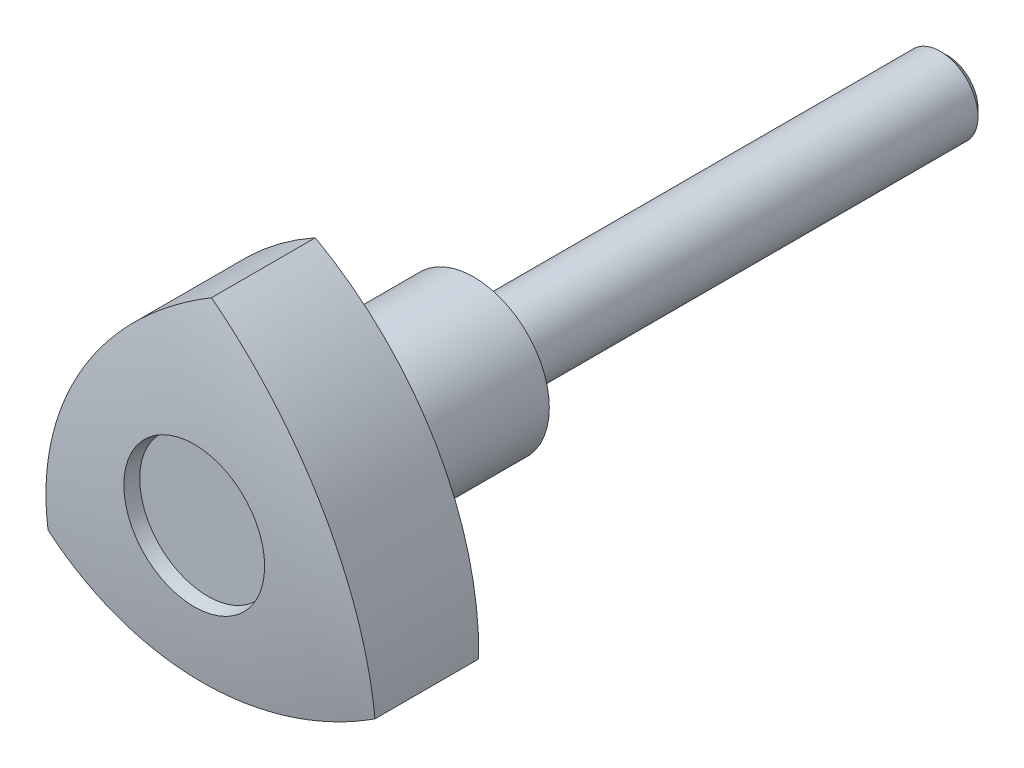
ISO-10303-21;
HEADER;
FILE_DESCRIPTION(('STEP AP214'),'2;1');
FILE_NAME('part.step','',(''),(''),'','','');
FILE_SCHEMA(('AUTOMOTIVE_DESIGN { 1 0 10303 214 1 1 1 1 }'));
ENDSEC;
DATA;
#1=APPLICATION_CONTEXT('core data for automotive mechanical design processes');
#2=APPLICATION_PROTOCOL_DEFINITION('international standard','automotive_design',2000,#1);
#3=PRODUCT_CONTEXT('',#1,'mechanical');
#4=PRODUCT('Part','Part','',(#3));
#5=PRODUCT_RELATED_PRODUCT_CATEGORY('part','',(#4));
#6=PRODUCT_DEFINITION_FORMATION('','',#4);
#7=PRODUCT_DEFINITION_CONTEXT('part definition',#1,'design');
#8=PRODUCT_DEFINITION('design','',#6,#7);
#9=PRODUCT_DEFINITION_SHAPE('','',#8);
#10=(LENGTH_UNIT() NAMED_UNIT(*) SI_UNIT(.MILLI.,.METRE.));
#11=(NAMED_UNIT(*) PLANE_ANGLE_UNIT() SI_UNIT($,.RADIAN.));
#12=(NAMED_UNIT(*) SI_UNIT($,.STERADIAN.) SOLID_ANGLE_UNIT());
#13=UNCERTAINTY_MEASURE_WITH_UNIT(LENGTH_MEASURE(1.E-05),#10,'distance_accuracy_value','');
#14=(GEOMETRIC_REPRESENTATION_CONTEXT(3) GLOBAL_UNCERTAINTY_ASSIGNED_CONTEXT((#13)) GLOBAL_UNIT_ASSIGNED_CONTEXT((#10,
#11,#12)) REPRESENTATION_CONTEXT('',''));
#15=CARTESIAN_POINT('',(0.,0.,0.));
#16=DIRECTION('',(0.,0.,1.));
#17=DIRECTION('',(1.,0.,0.));
#18=AXIS2_PLACEMENT_3D('',#15,#16,#17);
#19=CARTESIAN_POINT('',(0.,-5.2,17.));
#20=DIRECTION('',(0.,0.,-1.));
#21=DIRECTION('',(1.,0.,0.));
#22=AXIS2_PLACEMENT_3D('',#19,#20,#21);
#23=PLANE('',#22);
#24=CARTESIAN_POINT('',(0.,0.,17.));
#25=DIRECTION('',(0.,0.,1.));
#26=DIRECTION('',(-1.,0.,0.));
#27=AXIS2_PLACEMENT_3D('',#24,#25,#26);
#28=CIRCLE('',#27,5.2);
#29=CARTESIAN_POINT('',(-5.2,0.,17.));
#30=VERTEX_POINT('',#29);
#31=EDGE_CURVE('E19',#30,#30,#28,.T.);
#32=ORIENTED_EDGE('',*,*,#31,.T.);
#33=EDGE_LOOP('',(#32));
#34=FACE_BOUND('',#33,.T.);
#35=ADVANCED_FACE('F14',(#34),#23,.F.);
#36=CARTESIAN_POINT('',(0.,0.,27.3333333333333));
#37=DIRECTION('',(0.,0.,1.));
#38=DIRECTION('',(-1.,0.,0.));
#39=AXIS2_PLACEMENT_3D('',#36,#37,#38);
#40=CONICAL_SURFACE('',#39,7.02204546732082,0.174532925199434);
#41=CARTESIAN_POINT('',(0.,0.,27.3333333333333));
#42=DIRECTION('',(0.,0.,1.));
#43=DIRECTION('',(-1.,0.,0.));
#44=AXIS2_PLACEMENT_3D('',#41,#42,#43);
#45=CIRCLE('',#44,7.02204546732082);
#46=CARTESIAN_POINT('',(-7.02204546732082,0.,27.3333333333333));
#47=VERTEX_POINT('',#46);
#48=EDGE_CURVE('E137',#47,#47,#45,.T.);
#49=ORIENTED_EDGE('',*,*,#48,.T.);
#50=EDGE_LOOP('',(#49));
#51=FACE_BOUND('',#50,.T.);
#52=ORIENTED_EDGE('',*,*,#31,.F.);
#53=EDGE_LOOP('',(#52));
#54=FACE_BOUND('',#53,.T.);
#55=ADVANCED_FACE('F145',(#51,#54),#40,.F.);
#56=CARTESIAN_POINT('',(0.,-0.000999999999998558,27.3333333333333));
#57=DIRECTION('',(0.,0.,1.));
#58=DIRECTION('',(-1.,0.,0.));
#59=AXIS2_PLACEMENT_3D('',#56,#57,#58);
#60=PLANE('',#59);
#61=CARTESIAN_POINT('',(0.,0.,27.3333333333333));
#62=DIRECTION('',(0.,0.,-1.));
#63=DIRECTION('',(1.,0.,0.));
#64=AXIS2_PLACEMENT_3D('',#61,#62,#63);
#65=CIRCLE('',#64,0.000999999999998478);
#66=CARTESIAN_POINT('',(0.000999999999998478,0.,27.3333333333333));
#67=VERTEX_POINT('',#66);
#68=EDGE_CURVE('E135',#67,#67,#65,.F.);
#69=ORIENTED_EDGE('',*,*,#68,.T.);
#70=EDGE_LOOP('',(#69));
#71=FACE_BOUND('',#70,.T.);
#72=ORIENTED_EDGE('',*,*,#48,.F.);
#73=EDGE_LOOP('',(#72));
#74=FACE_BOUND('',#73,.T.);
#75=ADVANCED_FACE('F147',(#71,#74),#60,.F.);
#76=CARTESIAN_POINT('',(0.,0.,17.));
#77=DIRECTION('',(0.,0.,-1.));
#78=DIRECTION('',(1.,0.,0.));
#79=AXIS2_PLACEMENT_3D('',#76,#77,#78);
#80=CYLINDRICAL_SURFACE('',#79,0.000999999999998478);
#81=CARTESIAN_POINT('',(0.,0.,28.4));
#82=DIRECTION('',(0.,0.,-1.));
#83=DIRECTION('',(1.,0.,0.));
#84=AXIS2_PLACEMENT_3D('',#81,#82,#83);
#85=CIRCLE('',#84,0.000999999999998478);
#86=CARTESIAN_POINT('',(0.000999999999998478,0.,28.4));
#87=VERTEX_POINT('',#86);
#88=EDGE_CURVE('E132',#87,#87,#85,.F.);
#89=ORIENTED_EDGE('',*,*,#88,.T.);
#90=EDGE_LOOP('',(#89));
#91=FACE_BOUND('',#90,.T.);
#92=ORIENTED_EDGE('',*,*,#68,.F.);
#93=EDGE_LOOP('',(#92));
#94=FACE_BOUND('',#93,.T.);
#95=ADVANCED_FACE('F154',(#91,#94),#80,.F.);
#96=CARTESIAN_POINT('',(0.,-7.2101275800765,28.4));
#97=DIRECTION('',(0.,0.,-1.));
#98=DIRECTION('',(1.,0.,0.));
#99=AXIS2_PLACEMENT_3D('',#96,#97,#98);
#100=PLANE('',#99);
#101=CARTESIAN_POINT('',(0.,0.,28.4));
#102=DIRECTION('',(0.,0.,1.));
#103=DIRECTION('',(-1.,0.,0.));
#104=AXIS2_PLACEMENT_3D('',#101,#102,#103);
#105=CIRCLE('',#104,7.21012758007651);
#106=CARTESIAN_POINT('',(-7.21012758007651,0.,28.4));
#107=VERTEX_POINT('',#106);
#108=EDGE_CURVE('E77',#107,#107,#105,.T.);
#109=ORIENTED_EDGE('',*,*,#108,.T.);
#110=EDGE_LOOP('',(#109));
#111=FACE_BOUND('',#110,.T.);
#112=ORIENTED_EDGE('',*,*,#88,.F.);
#113=EDGE_LOOP('',(#112));
#114=FACE_BOUND('',#113,.T.);
#115=ADVANCED_FACE('F224',(#111,#114),#100,.F.);
#116=CARTESIAN_POINT('',(0.,0.,29.8316989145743));
#117=DIRECTION('',(0.,0.,1.));
#118=DIRECTION('',(-1.,0.,0.));
#119=AXIS2_PLACEMENT_3D('',#116,#117,#118);
#120=CONICAL_SURFACE('',#119,7.4625747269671,0.174532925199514);
#121=CARTESIAN_POINT('',(0.,0.,29.8316989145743));
#122=DIRECTION('',(0.,0.,-1.));
#123=DIRECTION('',(1.,0.,0.));
#124=AXIS2_PLACEMENT_3D('',#121,#122,#123);
#125=CIRCLE('',#124,7.46257472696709);
#126=CARTESIAN_POINT('',(7.46257472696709,0.,29.8316989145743));
#127=VERTEX_POINT('',#126);
#128=EDGE_CURVE('E59',#127,#127,#125,.T.);
#129=ORIENTED_EDGE('',*,*,#128,.F.);
#130=EDGE_LOOP('',(#129));
#131=FACE_BOUND('',#130,.T.);
#132=ORIENTED_EDGE('',*,*,#108,.F.);
#133=EDGE_LOOP('',(#132));
#134=FACE_BOUND('',#133,.T.);
#135=ADVANCED_FACE('F123',(#131,#134),#120,.F.);
#136=CARTESIAN_POINT('',(0.,0.,-52.2083333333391));
#137=DIRECTION('',(0.,0.,1.));
#138=DIRECTION('',(-1.,0.,0.));
#139=AXIS2_PLACEMENT_3D('',#136,#137,#138);
#140=DEGENERATE_TOROIDAL_SURFACE('',#139,1.87916666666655,82.2298080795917,.T.);
#141=ORIENTED_EDGE('',*,*,#128,.T.);
#142=EDGE_LOOP('',(#141));
#143=FACE_BOUND('',#142,.T.);
#144=CARTESIAN_POINT('',(0.,20.,28.));
#145=CARTESIAN_POINT('',(0.372642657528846,19.7932630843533,28.0467066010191));
#146=CARTESIAN_POINT('',(0.74147156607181,19.5793830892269,28.0918331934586));
#147=CARTESIAN_POINT('',(1.47101156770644,19.1375865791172,28.178894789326));
#148=CARTESIAN_POINT('',(1.83172263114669,18.9096700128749,28.2208297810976));
#149=CARTESIAN_POINT('',(2.90076609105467,18.2053565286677,28.3417798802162));
#150=CARTESIAN_POINT('',(3.59619057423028,17.7082949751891,28.4159628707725));
#151=CARTESIAN_POINT('',(4.94790509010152,16.6620571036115,28.5511708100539));
#152=CARTESIAN_POINT('',(5.60419538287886,16.1128811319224,28.6121958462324));
#153=CARTESIAN_POINT('',(6.87366086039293,14.9654936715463,28.7209726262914));
#154=CARTESIAN_POINT('',(7.48683405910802,14.3672799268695,28.7687237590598));
#155=CARTESIAN_POINT('',(8.71865863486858,13.0700716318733,28.8545535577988));
#156=CARTESIAN_POINT('',(9.33294869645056,12.366845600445,28.8913945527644));
#157=CARTESIAN_POINT('',(10.5012836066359,10.9113370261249,28.9492833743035));
#158=CARTESIAN_POINT('',(11.0553238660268,10.1590507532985,28.9703299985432));
#159=CARTESIAN_POINT('',(12.0991453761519,8.61069429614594,28.996665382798));
#160=CARTESIAN_POINT('',(12.588915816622,7.81461677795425,29.0019514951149));
#161=CARTESIAN_POINT('',(13.5005090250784,6.18456766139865,28.9967711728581));
#162=CARTESIAN_POINT('',(13.9223353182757,5.35059803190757,28.9863055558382));
#163=CARTESIAN_POINT('',(14.692719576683,3.65593233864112,28.9497108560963));
#164=CARTESIAN_POINT('',(15.0417071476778,2.79542945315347,28.9236773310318));
#165=CARTESIAN_POINT('',(15.6672761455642,1.04897441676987,28.8559880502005));
#166=CARTESIAN_POINT('',(15.9438491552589,0.16301932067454,28.8143304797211));
#167=CARTESIAN_POINT('',(16.4224738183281,-1.62689638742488,28.7154571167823));
#168=CARTESIAN_POINT('',(16.6246054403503,-2.5308365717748,28.6582581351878));
#169=CARTESIAN_POINT('',(16.9534969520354,-4.35087123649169,28.5284012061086));
#170=CARTESIAN_POINT('',(17.0802911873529,-5.26695998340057,28.4557503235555));
#171=CARTESIAN_POINT('',(17.2305634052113,-6.82078728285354,28.3200368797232));
#172=CARTESIAN_POINT('',(17.2738628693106,-7.45703003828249,28.2609528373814));
#173=CARTESIAN_POINT('',(17.3242365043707,-8.72906049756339,28.1357415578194));
#174=CARTESIAN_POINT('',(17.3313778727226,-9.36484684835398,28.0696276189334));
#175=CARTESIAN_POINT('',(17.3205080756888,-10.,28.));
#176=B_SPLINE_CURVE_WITH_KNOTS('',3,(#144,#145,#146,#147,#148,#149,#150,#151,#152,#153,#154,
#155,#156,#157,#158,#159,#160,#161,#162,#163,#164,#165,#166,#167,#168,#169,#170,#171,#172,#173,
#174,#175),.UNSPECIFIED.,.F.,.F.,(4,2,2,2,2,2,2,2,2,2,2,2,2,2,2,4),(0.,1.28593682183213,
2.5718783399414,5.14313559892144,7.71437576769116,10.2857342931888,13.0857434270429,
15.8859656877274,18.6866583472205,21.4872056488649,24.2707368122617,27.0545913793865,
29.835446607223,32.6150330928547,34.5353707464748,36.4521382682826),.UNSPECIFIED.);
#177=CARTESIAN_POINT('',(0.,20.,28.));
#178=VERTEX_POINT('',#177);
#179=CARTESIAN_POINT('',(17.3205080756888,-10.,28.));
#180=VERTEX_POINT('',#179);
#181=EDGE_CURVE('E49',#178,#180,#176,.T.);
#182=ORIENTED_EDGE('',*,*,#181,.F.);
#183=CARTESIAN_POINT('',(-17.3205080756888,-10.,28.));
#184=CARTESIAN_POINT('',(-17.3277899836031,-9.57391353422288,28.0467066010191));
#185=CARTESIAN_POINT('',(-17.3269789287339,-9.14755833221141,28.0918331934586));
#186=CARTESIAN_POINT('',(-17.3091419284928,-8.29485990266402,28.178894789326));
#187=CARTESIAN_POINT('',(-17.2921159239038,-7.86851667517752,28.2208297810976));
#188=CARTESIAN_POINT('',(-17.2166842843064,-6.59054113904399,28.3417798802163));
#189=CARTESIAN_POINT('',(-17.1339285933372,-5.73975509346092,28.4159628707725));
#190=CARTESIAN_POINT('',(-16.9037172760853,-4.04601704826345,28.5511708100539));
#191=CARTESIAN_POINT('',(-16.7562620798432,-3.2030649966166,28.6121958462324));
#192=CARTESIAN_POINT('',(-16.3973281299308,-1.52998191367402,28.7209726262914));
#193=CARTESIAN_POINT('',(-16.1858464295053,-0.699851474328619,28.7687237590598));
#194=CARTESIAN_POINT('',(-15.6783433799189,1.01554404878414,28.8545535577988));
#195=CARTESIAN_POINT('',(-15.3764768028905,1.89914786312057,28.8913945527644));
#196=CARTESIAN_POINT('',(-14.7001368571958,3.63870986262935,28.9492833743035));
#197=CARTESIAN_POINT('',(-14.3256579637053,4.49466593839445,28.9703299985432));
#198=CARTESIAN_POINT('',(-13.5066526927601,6.1728201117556,28.996665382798));
#199=CARTESIAN_POINT('',(-13.0621145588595,6.99501251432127,29.0019514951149));
#200=CARTESIAN_POINT('',(-12.1062472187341,8.59949994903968,28.9967711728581));
#201=CARTESIAN_POINT('',(-11.5949214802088,9.38179704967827,28.9863055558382));
#202=CARTESIAN_POINT('',(-10.5124900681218,10.8963022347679,28.9497108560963));
#203=CARTESIAN_POINT('',(-9.94176649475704,11.6287857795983,28.9236773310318));
#204=CARTESIAN_POINT('',(-8.74207656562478,13.0437719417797,28.8559880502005));
#205=CARTESIAN_POINT('',(-8.11310345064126,13.726268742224,28.8143304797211));
#206=CARTESIAN_POINT('',(-6.80230330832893,15.0357277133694,28.7154571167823));
#207=CARTESIAN_POINT('',(-6.12053395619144,15.6627489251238,28.6582581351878));
#208=CARTESIAN_POINT('',(-4.70878345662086,16.8575946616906,28.5284012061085));
#209=CARTESIAN_POINT('',(-3.97882444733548,17.4254460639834,28.4557503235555));
#210=CARTESIAN_POINT('',(-2.70830664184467,18.3324992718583,28.3200368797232));
#211=CARTESIAN_POINT('',(-2.17895398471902,18.688119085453,28.2609528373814));
#212=CARTESIAN_POINT('',(-1.10253011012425,19.3677591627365,28.1357415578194));
#213=CARTESIAN_POINT('',(-0.555493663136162,19.6918369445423,28.0696276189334));
#214=CARTESIAN_POINT('',(0.,20.,28.));
#215=B_SPLINE_CURVE_WITH_KNOTS('',3,(#183,#184,#185,#186,#187,#188,#189,#190,#191,#192,#193,
#194,#195,#196,#197,#198,#199,#200,#201,#202,#203,#204,#205,#206,#207,#208,#209,#210,#211,#212,
#213,#214),.UNSPECIFIED.,.F.,.F.,(4,2,2,2,2,2,2,2,2,2,2,2,2,2,2,4),(0.,1.28593682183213,
2.5718783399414,5.14313559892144,7.71437576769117,10.2857342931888,13.0857434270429,
15.8859656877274,18.6866583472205,21.4872056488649,24.2707368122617,27.0545913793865,
29.835446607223,32.6150330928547,34.5353707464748,36.4521382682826),.UNSPECIFIED.);
#216=CARTESIAN_POINT('',(-17.3205080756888,-10.,28.));
#217=VERTEX_POINT('',#216);
#218=EDGE_CURVE('E58',#217,#178,#215,.T.);
#219=ORIENTED_EDGE('',*,*,#218,.F.);
#220=CARTESIAN_POINT('',(17.3205080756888,-10.,28.));
#221=CARTESIAN_POINT('',(16.9551473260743,-10.2193495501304,28.0467066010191));
#222=CARTESIAN_POINT('',(16.5855073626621,-10.4318247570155,28.0918331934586));
#223=CARTESIAN_POINT('',(15.8381303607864,-10.8427266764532,28.178894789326));
#224=CARTESIAN_POINT('',(15.4603932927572,-11.0411533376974,28.2208297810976));
#225=CARTESIAN_POINT('',(14.3159181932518,-11.6148153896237,28.3417798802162));
#226=CARTESIAN_POINT('',(13.5377380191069,-11.9685398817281,28.4159628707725));
#227=CARTESIAN_POINT('',(11.9558121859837,-12.616040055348,28.5511708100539));
#228=CARTESIAN_POINT('',(11.1520666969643,-12.9098161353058,28.6121958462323));
#229=CARTESIAN_POINT('',(9.52366726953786,-13.4355117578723,28.7209726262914));
#230=CARTESIAN_POINT('',(8.69901237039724,-13.6674284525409,28.7687237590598));
#231=CARTESIAN_POINT('',(6.9596847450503,-14.0856156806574,28.8545535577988));
#232=CARTESIAN_POINT('',(6.04352810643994,-14.2659934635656,28.8913945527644));
#233=CARTESIAN_POINT('',(4.19885325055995,-14.5500468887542,28.9492833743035));
#234=CARTESIAN_POINT('',(3.27033409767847,-14.6537166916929,28.9703299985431));
#235=CARTESIAN_POINT('',(1.40750731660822,-14.7835144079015,28.996665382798));
#236=CARTESIAN_POINT('',(0.473198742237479,-14.8096292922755,29.0019514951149));
#237=CARTESIAN_POINT('',(-1.39426180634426,-14.7840676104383,28.9967711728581));
#238=CARTESIAN_POINT('',(-2.32741383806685,-14.7323950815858,28.9863055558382));
#239=CARTESIAN_POINT('',(-4.18022950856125,-14.552234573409,28.9497108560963));
#240=CARTESIAN_POINT('',(-5.09994065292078,-14.4242152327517,28.9236773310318));
#241=CARTESIAN_POINT('',(-6.92519957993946,-14.0927463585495,28.8559880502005));
#242=CARTESIAN_POINT('',(-7.83074570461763,-13.8892880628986,28.8143304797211));
#243=CARTESIAN_POINT('',(-9.62017050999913,-13.4088313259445,28.7154571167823));
#244=CARTESIAN_POINT('',(-10.5040714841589,-13.131912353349,28.6582581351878));
#245=CARTESIAN_POINT('',(-12.2447134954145,-12.5067234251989,28.5284012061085));
#246=CARTESIAN_POINT('',(-13.1014667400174,-12.1584860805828,28.4557503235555));
#247=CARTESIAN_POINT('',(-14.5222567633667,-11.5117119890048,28.3200368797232));
#248=CARTESIAN_POINT('',(-15.0949088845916,-11.2310890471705,28.2609528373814));
#249=CARTESIAN_POINT('',(-16.2217063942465,-10.6386986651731,28.1357415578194));
#250=CARTESIAN_POINT('',(-16.7758842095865,-10.3269900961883,28.0696276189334));
#251=CARTESIAN_POINT('',(-17.3205080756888,-10.,28.));
#252=B_SPLINE_CURVE_WITH_KNOTS('',3,(#220,#221,#222,#223,#224,#225,#226,#227,#228,#229,#230,
#231,#232,#233,#234,#235,#236,#237,#238,#239,#240,#241,#242,#243,#244,#245,#246,#247,#248,#249,
#250,#251),.UNSPECIFIED.,.F.,.F.,(4,2,2,2,2,2,2,2,2,2,2,2,2,2,2,4),(0.,1.28593682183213,
2.5718783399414,5.14313559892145,7.71437576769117,10.2857342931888,13.0857434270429,
15.8859656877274,18.6866583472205,21.4872056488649,24.2707368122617,27.0545913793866,
29.8354466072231,32.6150330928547,34.5353707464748,36.4521382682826),.UNSPECIFIED.);
#253=EDGE_CURVE('E62',#180,#217,#252,.T.);
#254=ORIENTED_EDGE('',*,*,#253,.F.);
#255=EDGE_LOOP('',(#182,#219,#254));
#256=FACE_BOUND('',#255,.T.);
#257=ADVANCED_FACE('F16',(#143,#256),#140,.T.);
#258=CARTESIAN_POINT('',(-16.3245788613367,-9.425,40.));
#259=DIRECTION('',(0.,0.,1.));
#260=DIRECTION('',(-1.,0.,0.));
#261=AXIS2_PLACEMENT_3D('',#258,#259,#260);
#262=CYLINDRICAL_SURFACE('',#261,33.65);
#263=DIRECTION('',(0.,0.,1.));
#264=VECTOR('',#263,1.);
#265=CARTESIAN_POINT('',(17.3205080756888,-10.,40.));
#266=LINE('',#265,#264);
#267=CARTESIAN_POINT('',(17.3205080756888,-10.,17.));
#268=VERTEX_POINT('',#267);
#269=EDGE_CURVE('E54',#268,#180,#266,.T.);
#270=ORIENTED_EDGE('',*,*,#269,.F.);
#271=CARTESIAN_POINT('',(-16.3245788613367,-9.425,17.));
#272=DIRECTION('',(0.,0.,1.));
#273=DIRECTION('',(-1.,0.,0.));
#274=AXIS2_PLACEMENT_3D('',#271,#272,#273);
#275=CIRCLE('',#274,33.65);
#276=CARTESIAN_POINT('',(0.,20.,17.));
#277=VERTEX_POINT('',#276);
#278=EDGE_CURVE('E99',#268,#277,#275,.T.);
#279=ORIENTED_EDGE('',*,*,#278,.T.);
#280=DIRECTION('',(0.,0.,1.));
#281=VECTOR('',#280,1.);
#282=CARTESIAN_POINT('',(0.,20.,40.));
#283=LINE('',#282,#281);
#284=EDGE_CURVE('E56',#178,#277,#283,.F.);
#285=ORIENTED_EDGE('',*,*,#284,.F.);
#286=ORIENTED_EDGE('',*,*,#181,.T.);
#287=EDGE_LOOP('',(#270,#279,#285,#286));
#288=FACE_BOUND('',#287,.T.);
#289=ADVANCED_FACE('F52',(#288),#262,.T.);
#290=CARTESIAN_POINT('',(16.3245788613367,-9.425,40.));
#291=DIRECTION('',(0.,0.,1.));
#292=DIRECTION('',(-1.,0.,0.));
#293=AXIS2_PLACEMENT_3D('',#290,#291,#292);
#294=CYLINDRICAL_SURFACE('',#293,33.65);
#295=ORIENTED_EDGE('',*,*,#284,.T.);
#296=CARTESIAN_POINT('',(16.3245788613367,-9.425,17.));
#297=DIRECTION('',(0.,0.,1.));
#298=DIRECTION('',(-1.,0.,0.));
#299=AXIS2_PLACEMENT_3D('',#296,#297,#298);
#300=CIRCLE('',#299,33.65);
#301=CARTESIAN_POINT('',(-17.3205080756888,-10.,17.));
#302=VERTEX_POINT('',#301);
#303=EDGE_CURVE('E34',#277,#302,#300,.T.);
#304=ORIENTED_EDGE('',*,*,#303,.T.);
#305=DIRECTION('',(0.,0.,1.));
#306=VECTOR('',#305,1.);
#307=CARTESIAN_POINT('',(-17.3205080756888,-10.,40.));
#308=LINE('',#307,#306);
#309=EDGE_CURVE('E64',#217,#302,#308,.F.);
#310=ORIENTED_EDGE('',*,*,#309,.F.);
#311=ORIENTED_EDGE('',*,*,#218,.T.);
#312=EDGE_LOOP('',(#295,#304,#310,#311));
#313=FACE_BOUND('',#312,.T.);
#314=ADVANCED_FACE('F115',(#313),#294,.T.);
#315=CARTESIAN_POINT('',(0.,18.85,40.));
#316=DIRECTION('',(0.,0.,1.));
#317=DIRECTION('',(-1.,0.,0.));
#318=AXIS2_PLACEMENT_3D('',#315,#316,#317);
#319=CYLINDRICAL_SURFACE('',#318,33.65);
#320=ORIENTED_EDGE('',*,*,#309,.T.);
#321=CARTESIAN_POINT('',(0.,18.85,17.));
#322=DIRECTION('',(0.,0.,1.));
#323=DIRECTION('',(-1.,0.,0.));
#324=AXIS2_PLACEMENT_3D('',#321,#322,#323);
#325=CIRCLE('',#324,33.65);
#326=EDGE_CURVE('E68',#302,#268,#325,.T.);
#327=ORIENTED_EDGE('',*,*,#326,.T.);
#328=ORIENTED_EDGE('',*,*,#269,.T.);
#329=ORIENTED_EDGE('',*,*,#253,.T.);
#330=EDGE_LOOP('',(#320,#327,#328,#329));
#331=FACE_BOUND('',#330,.T.);
#332=ADVANCED_FACE('F66',(#331),#319,.T.);
#333=CARTESIAN_POINT('',(0.,-8.,17.));
#334=DIRECTION('',(0.,0.,1.));
#335=DIRECTION('',(-1.,0.,0.));
#336=AXIS2_PLACEMENT_3D('',#333,#334,#335);
#337=PLANE('',#336);
#338=CARTESIAN_POINT('',(0.,0.,17.));
#339=DIRECTION('',(0.,0.,-1.));
#340=DIRECTION('',(1.,0.,0.));
#341=AXIS2_PLACEMENT_3D('',#338,#339,#340);
#342=CIRCLE('',#341,8.);
#343=CARTESIAN_POINT('',(8.,0.,17.));
#344=VERTEX_POINT('',#343);
#345=EDGE_CURVE('E94',#344,#344,#342,.T.);
#346=ORIENTED_EDGE('',*,*,#345,.F.);
#347=EDGE_LOOP('',(#346));
#348=FACE_BOUND('',#347,.T.);
#349=ORIENTED_EDGE('',*,*,#303,.F.);
#350=ORIENTED_EDGE('',*,*,#278,.F.);
#351=ORIENTED_EDGE('',*,*,#326,.F.);
#352=EDGE_LOOP('',(#349,#350,#351));
#353=FACE_BOUND('',#352,.T.);
#354=ADVANCED_FACE('F114',(#348,#353),#337,.F.);
#355=CARTESIAN_POINT('',(0.,0.,17.));
#356=DIRECTION('',(0.,0.,-1.));
#357=DIRECTION('',(1.,0.,0.));
#358=AXIS2_PLACEMENT_3D('',#355,#356,#357);
#359=CYLINDRICAL_SURFACE('',#358,8.);
#360=CARTESIAN_POINT('',(0.,0.,0.2));
#361=DIRECTION('',(0.,0.,-1.));
#362=DIRECTION('',(1.,0.,0.));
#363=AXIS2_PLACEMENT_3D('',#360,#361,#362);
#364=CIRCLE('',#363,8.);
#365=CARTESIAN_POINT('',(8.,0.,0.2));
#366=VERTEX_POINT('',#365);
#367=EDGE_CURVE('E91',#366,#366,#364,.F.);
#368=ORIENTED_EDGE('',*,*,#367,.T.);
#369=EDGE_LOOP('',(#368));
#370=FACE_BOUND('',#369,.T.);
#371=ORIENTED_EDGE('',*,*,#345,.T.);
#372=EDGE_LOOP('',(#371));
#373=FACE_BOUND('',#372,.T.);
#374=ADVANCED_FACE('F183',(#370,#373),#359,.T.);
#375=CARTESIAN_POINT('',(0.,-5.2,0.2));
#376=DIRECTION('',(0.,0.,1.));
#377=DIRECTION('',(-1.,0.,0.));
#378=AXIS2_PLACEMENT_3D('',#375,#376,#377);
#379=PLANE('',#378);
#380=CARTESIAN_POINT('',(0.,0.,0.2));
#381=DIRECTION('',(0.,0.,-1.));
#382=DIRECTION('',(1.,0.,0.));
#383=AXIS2_PLACEMENT_3D('',#380,#381,#382);
#384=CIRCLE('',#383,5.2);
#385=CARTESIAN_POINT('',(5.2,0.,0.2));
#386=VERTEX_POINT('',#385);
#387=EDGE_CURVE('E88',#386,#386,#384,.T.);
#388=ORIENTED_EDGE('',*,*,#387,.F.);
#389=EDGE_LOOP('',(#388));
#390=FACE_BOUND('',#389,.T.);
#391=ORIENTED_EDGE('',*,*,#367,.F.);
#392=EDGE_LOOP('',(#391));
#393=FACE_BOUND('',#392,.T.);
#394=ADVANCED_FACE('F180',(#390,#393),#379,.F.);
#395=CARTESIAN_POINT('',(0.,0.,17.));
#396=DIRECTION('',(0.,0.,-1.));
#397=DIRECTION('',(1.,0.,0.));
#398=AXIS2_PLACEMENT_3D('',#395,#396,#397);
#399=CYLINDRICAL_SURFACE('',#398,5.2);
#400=CARTESIAN_POINT('',(0.,0.,0.));
#401=DIRECTION('',(0.,0.,-1.));
#402=DIRECTION('',(1.,0.,0.));
#403=AXIS2_PLACEMENT_3D('',#400,#401,#402);
#404=CIRCLE('',#403,5.2);
#405=CARTESIAN_POINT('',(5.2,0.,0.));
#406=VERTEX_POINT('',#405);
#407=EDGE_CURVE('E85',#406,#406,#404,.F.);
#408=ORIENTED_EDGE('',*,*,#407,.T.);
#409=EDGE_LOOP('',(#408));
#410=FACE_BOUND('',#409,.T.);
#411=ORIENTED_EDGE('',*,*,#387,.T.);
#412=EDGE_LOOP('',(#411));
#413=FACE_BOUND('',#412,.T.);
#414=ADVANCED_FACE('F176',(#410,#413),#399,.T.);
#415=CARTESIAN_POINT('',(0.,0.,-50.));
#416=DIRECTION('',(0.,0.,1.));
#417=DIRECTION('',(-1.,0.,0.));
#418=AXIS2_PLACEMENT_3D('',#415,#416,#417);
#419=PLANE('',#418);
#420=CARTESIAN_POINT('',(0.,0.,-50.0000000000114));
#421=DIRECTION('',(0.,0.,1.));
#422=DIRECTION('',(-1.,0.,0.));
#423=AXIS2_PLACEMENT_3D('',#420,#421,#422);
#424=CIRCLE('',#423,3.23300000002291);
#425=CARTESIAN_POINT('',(-3.23300000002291,0.,-50.0000000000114));
#426=VERTEX_POINT('',#425);
#427=EDGE_CURVE('E82',#426,#426,#424,.T.);
#428=ORIENTED_EDGE('',*,*,#427,.F.);
#429=EDGE_LOOP('',(#428));
#430=FACE_BOUND('',#429,.T.);
#431=ADVANCED_FACE('F172',(#430),#419,.F.);
#432=CARTESIAN_POINT('',(0.,-4.,0.));
#433=DIRECTION('',(0.,0.,1.));
#434=DIRECTION('',(-1.,0.,0.));
#435=AXIS2_PLACEMENT_3D('',#432,#433,#434);
#436=PLANE('',#435);
#437=CARTESIAN_POINT('',(0.,0.,0.));
#438=DIRECTION('',(0.,0.,-1.));
#439=DIRECTION('',(1.,0.,0.));
#440=AXIS2_PLACEMENT_3D('',#437,#438,#439);
#441=CIRCLE('',#440,4.);
#442=CARTESIAN_POINT('',(4.,0.,0.));
#443=VERTEX_POINT('',#442);
#444=EDGE_CURVE('E25',#443,#443,#441,.T.);
#445=ORIENTED_EDGE('',*,*,#444,.F.);
#446=EDGE_LOOP('',(#445));
#447=FACE_BOUND('',#446,.T.);
#448=ORIENTED_EDGE('',*,*,#407,.F.);
#449=EDGE_LOOP('',(#448));
#450=FACE_BOUND('',#449,.T.);
#451=ADVANCED_FACE('F165',(#447,#450),#436,.F.);
#452=CARTESIAN_POINT('',(0.,0.,-49.2330000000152));
#453=DIRECTION('',(0.,0.,1.));
#454=DIRECTION('',(-1.,0.,0.));
#455=AXIS2_PLACEMENT_3D('',#452,#453,#454);
#456=CONICAL_SURFACE('',#455,4.00000000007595,0.785398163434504);
#457=ORIENTED_EDGE('',*,*,#427,.T.);
#458=EDGE_LOOP('',(#457));
#459=FACE_BOUND('',#458,.T.);
#460=CARTESIAN_POINT('',(0.,0.,-49.233));
#461=DIRECTION('',(0.,0.,-1.));
#462=DIRECTION('',(1.,0.,0.));
#463=AXIS2_PLACEMENT_3D('',#460,#461,#462);
#464=CIRCLE('',#463,4.);
#465=CARTESIAN_POINT('',(4.,0.,-49.233));
#466=VERTEX_POINT('',#465);
#467=EDGE_CURVE('E9',#466,#466,#464,.F.);
#468=ORIENTED_EDGE('',*,*,#467,.F.);
#469=EDGE_LOOP('',(#468));
#470=FACE_BOUND('',#469,.T.);
#471=ADVANCED_FACE('F159',(#459,#470),#456,.T.);
#472=CARTESIAN_POINT('',(0.,0.,17.));
#473=DIRECTION('',(0.,0.,-1.));
#474=DIRECTION('',(1.,0.,0.));
#475=AXIS2_PLACEMENT_3D('',#472,#473,#474);
#476=CYLINDRICAL_SURFACE('',#475,4.);
#477=ORIENTED_EDGE('',*,*,#467,.T.);
#478=EDGE_LOOP('',(#477));
#479=FACE_BOUND('',#478,.T.);
#480=ORIENTED_EDGE('',*,*,#444,.T.);
#481=EDGE_LOOP('',(#480));
#482=FACE_BOUND('',#481,.T.);
#483=ADVANCED_FACE('F157',(#479,#482),#476,.T.);
#484=CLOSED_SHELL('',(#35,#55,#75,#95,#115,#135,#257,#289,#314,#332,#354,#374,#394,#414,#431,
#451,#471,#483));
#485=MANIFOLD_SOLID_BREP('B1',#484);
#486=ADVANCED_BREP_SHAPE_REPRESENTATION('',(#18,#485),#14);
#487=SHAPE_DEFINITION_REPRESENTATION(#9,#486);
ENDSEC;
END-ISO-10303-21;
